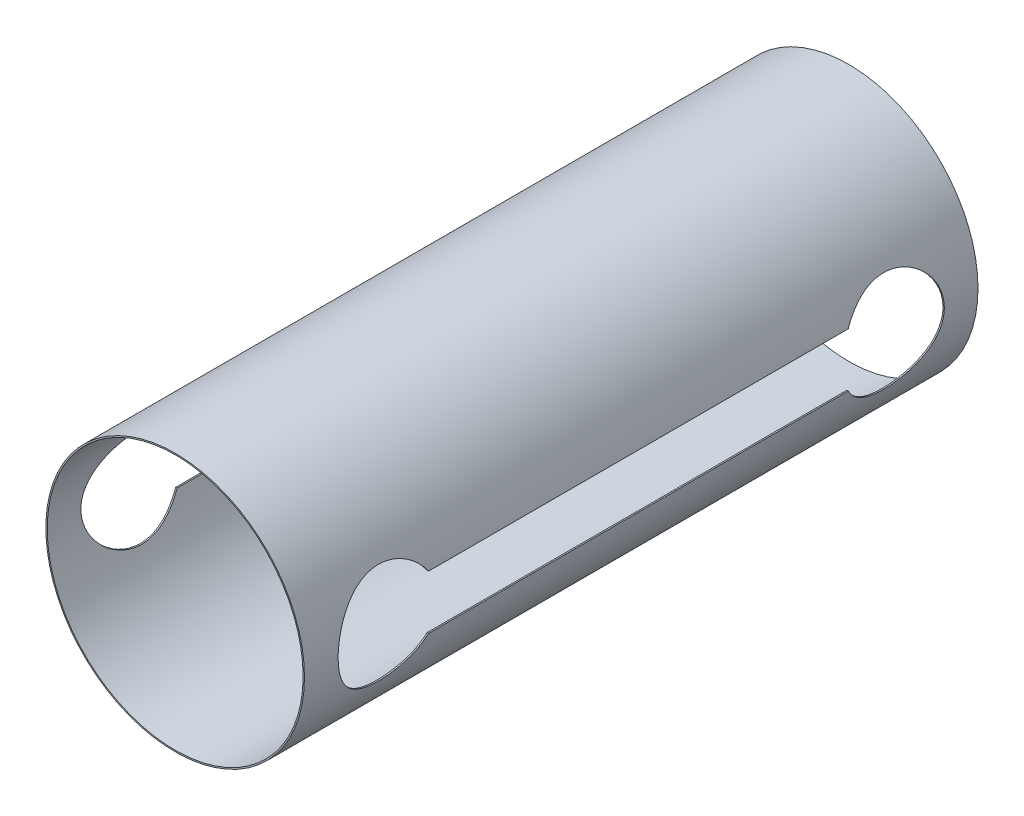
from build123d import *

# Parameters (mm, degrees)
SKETCH1_R               = 19.2
SKETCH1_R_2             = 19
BOSS_EXTRUDE1_DEPTH     = 100
CUT_EXTRUDE1_DEPTH      = 104.620847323
CUT_EXTRUDE1_DEPTH_BACK = 104.620847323


with BuildPart() as part:
    # Sketch1 → Boss-Extrude1 (new body)
    with BuildSketch(Plane.XY):
        Circle(SKETCH1_R)
        Circle(SKETCH1_R_2, mode=Mode.SUBTRACT)
    extrude(amount=-BOSS_EXTRUDE1_DEPTH)

    # Sketch2 → Cut-Extrude1 (cut, two sides: drawn at the far end of the back side and taken through both)
    with BuildSketch(Plane(origin=(0, 0, 0), x_dir=(0, 0, -1), z_dir=(1, 0, 0)).offset(-CUT_EXTRUDE1_DEPTH_BACK)):
        with BuildLine():
            Line((18.84428877, 4), (81.15571123, 4))
            ThreePointArc((81.15571123, 4), (95, 0), (81.15571123, -4))
            Line((81.15571123, -4), (18.84428877, -4))
            ThreePointArc((18.84428877, -4), (5, 0), (18.84428877, 4))
        make_face()
    extrude(amount=CUT_EXTRUDE1_DEPTH + CUT_EXTRUDE1_DEPTH_BACK, mode=Mode.SUBTRACT)


solid = part.part
